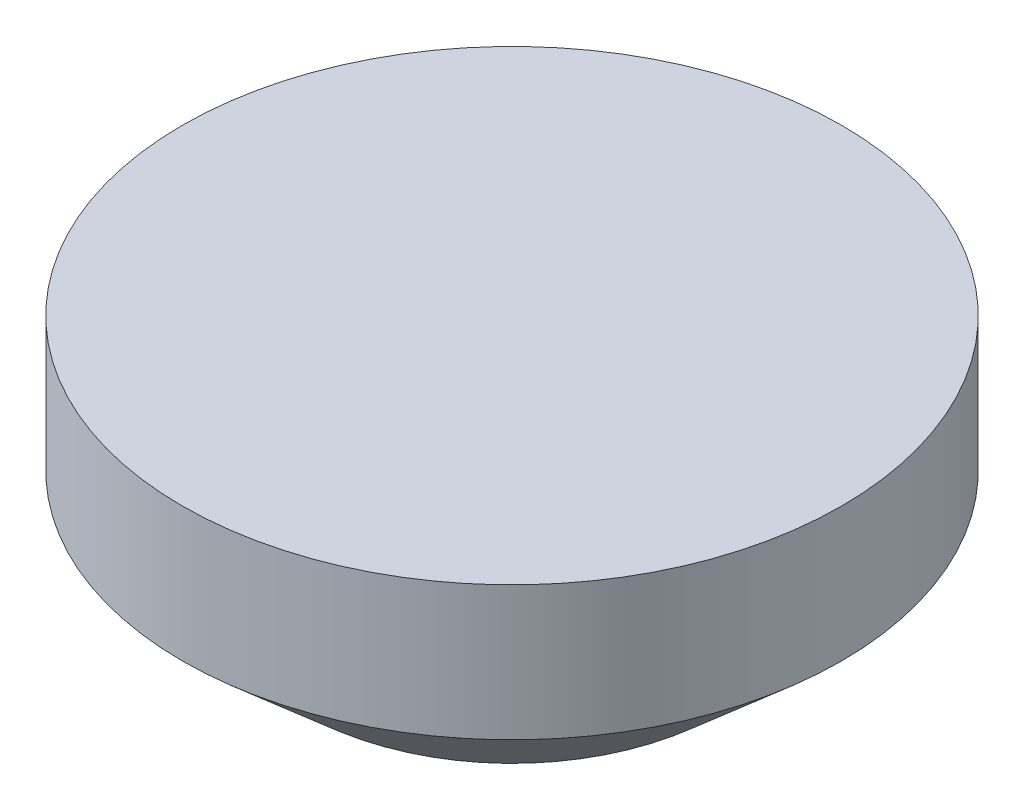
from build123d import *


with BuildPart() as part:
    # Sketch 1 → Revolve 1 (revolve)
    with BuildSketch(Plane.XY, mode=Mode.PRIVATE) as revolve_1_sk:
        Polygon((0, 410), (-565, 410), (-565, 180), (-360, 0), (0, 0), align=None)
    revolve(revolve_1_sk.sketch.rotate(Axis((0, 0, 0), (0, 1, 0)), 270), axis=Axis((0, 0, 0), (0, 1, 0)))


solid = part.part
